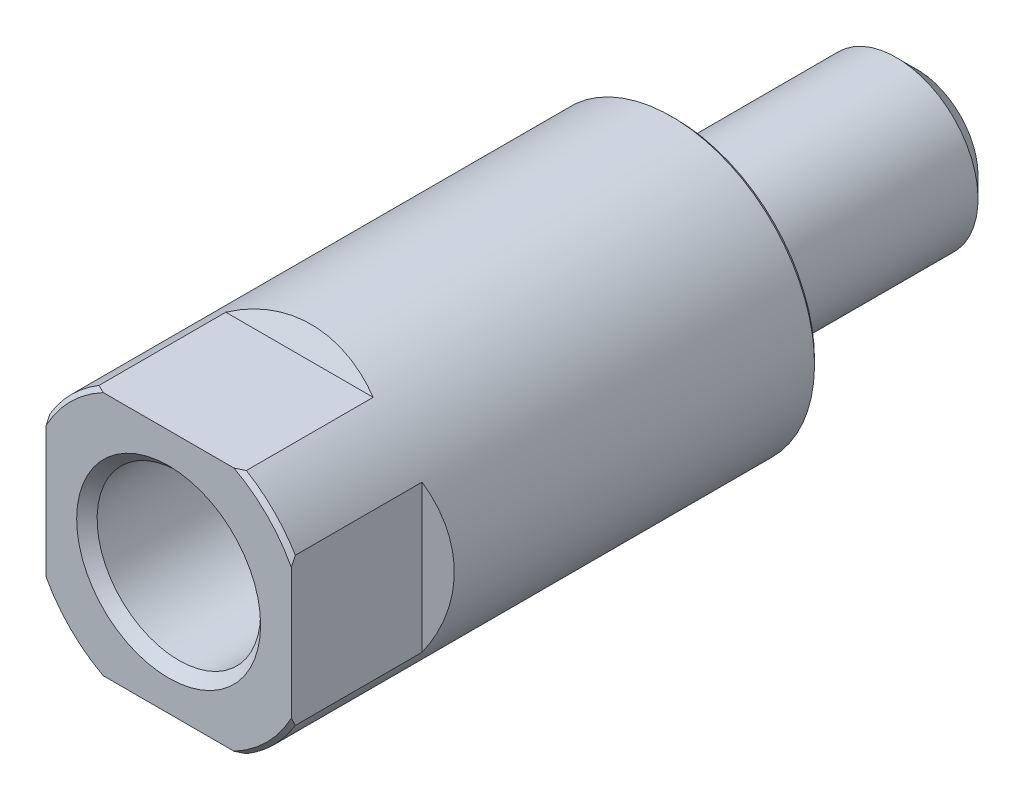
ISO-10303-21;
HEADER;
FILE_DESCRIPTION(('STEP AP214'),'2;1');
FILE_NAME('part.step','',(''),(''),'','','');
FILE_SCHEMA(('AUTOMOTIVE_DESIGN { 1 0 10303 214 1 1 1 1 }'));
ENDSEC;
DATA;
#1=APPLICATION_CONTEXT('core data for automotive mechanical design processes');
#2=APPLICATION_PROTOCOL_DEFINITION('international standard','automotive_design',2000,#1);
#3=PRODUCT_CONTEXT('',#1,'mechanical');
#4=PRODUCT('Part','Part','',(#3));
#5=PRODUCT_RELATED_PRODUCT_CATEGORY('part','',(#4));
#6=PRODUCT_DEFINITION_FORMATION('','',#4);
#7=PRODUCT_DEFINITION_CONTEXT('part definition',#1,'design');
#8=PRODUCT_DEFINITION('design','',#6,#7);
#9=PRODUCT_DEFINITION_SHAPE('','',#8);
#10=(LENGTH_UNIT() NAMED_UNIT(*) SI_UNIT(.MILLI.,.METRE.));
#11=(NAMED_UNIT(*) PLANE_ANGLE_UNIT() SI_UNIT($,.RADIAN.));
#12=(NAMED_UNIT(*) SI_UNIT($,.STERADIAN.) SOLID_ANGLE_UNIT());
#13=UNCERTAINTY_MEASURE_WITH_UNIT(LENGTH_MEASURE(1.E-05),#10,'distance_accuracy_value','');
#14=(GEOMETRIC_REPRESENTATION_CONTEXT(3) GLOBAL_UNCERTAINTY_ASSIGNED_CONTEXT((#13)) GLOBAL_UNIT_ASSIGNED_CONTEXT((#10,
#11,#12)) REPRESENTATION_CONTEXT('',''));
#15=CARTESIAN_POINT('',(0.,0.,0.));
#16=DIRECTION('',(0.,0.,1.));
#17=DIRECTION('',(1.,0.,0.));
#18=AXIS2_PLACEMENT_3D('',#15,#16,#17);
#19=CARTESIAN_POINT('',(0.,0.,-9.));
#20=DIRECTION('',(0.,0.,1.));
#21=DIRECTION('',(0.,-1.,0.));
#22=AXIS2_PLACEMENT_3D('',#19,#20,#21);
#23=CYLINDRICAL_SURFACE('',#22,10.);
#24=CARTESIAN_POINT('',(0.,0.,1.25));
#25=DIRECTION('',(0.,0.,-1.));
#26=DIRECTION('',(0.,1.,0.));
#27=AXIS2_PLACEMENT_3D('',#24,#25,#26);
#28=CIRCLE('',#27,10.);
#29=CARTESIAN_POINT('',(0.,10.,1.25));
#30=VERTEX_POINT('',#29);
#31=EDGE_CURVE('E9',#30,#30,#28,.F.);
#32=ORIENTED_EDGE('',*,*,#31,.F.);
#33=EDGE_LOOP('',(#32));
#34=FACE_BOUND('',#33,.T.);
#35=CARTESIAN_POINT('',(0.,0.,-27.));
#36=DIRECTION('',(0.,0.,1.));
#37=DIRECTION('',(0.,-1.,0.));
#38=AXIS2_PLACEMENT_3D('',#35,#36,#37);
#39=CIRCLE('',#38,10.);
#40=CARTESIAN_POINT('',(0.,-10.,-27.));
#41=VERTEX_POINT('',#40);
#42=EDGE_CURVE('E367',#41,#41,#39,.T.);
#43=ORIENTED_EDGE('',*,*,#42,.T.);
#44=EDGE_LOOP('',(#43));
#45=FACE_BOUND('',#44,.T.);
#46=ADVANCED_FACE('F14',(#34,#45),#23,.T.);
#47=CARTESIAN_POINT('',(-15.,10.,46.));
#48=DIRECTION('',(0.5,0.,-0.866025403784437));
#49=DIRECTION('',(0.866025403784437,0.,0.5));
#50=AXIS2_PLACEMENT_3D('',#47,#48,#49);
#51=PLANE('',#50);
#52=CARTESIAN_POINT('',(0.,0.,54.6602540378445));
#53=DIRECTION('',(0.5,0.,-0.866025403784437));
#54=DIRECTION('',(-0.866025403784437,0.,-0.5));
#55=AXIS2_PLACEMENT_3D('',#52,#53,#54);
#56=ELLIPSE('',#55,20.2072594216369,17.5);
#57=CARTESIAN_POINT('',(-15.,-9.01387818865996,46.));
#58=VERTEX_POINT('',#57);
#59=CARTESIAN_POINT('',(-15.,9.01387818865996,46.));
#60=VERTEX_POINT('',#59);
#61=EDGE_CURVE('E163',#58,#60,#56,.T.);
#62=ORIENTED_EDGE('',*,*,#61,.F.);
#63=DIRECTION('',(0.,-1.,0.));
#64=VECTOR('',#63,1.);
#65=CARTESIAN_POINT('',(-15.,10.,46.));
#66=LINE('',#65,#64);
#67=EDGE_CURVE('E139',#60,#58,#66,.T.);
#68=ORIENTED_EDGE('',*,*,#67,.F.);
#69=EDGE_LOOP('',(#62,#68));
#70=FACE_BOUND('',#69,.T.);
#71=ADVANCED_FACE('F207',(#70),#51,.F.);
#72=CARTESIAN_POINT('',(10.,-15.,46.));
#73=DIRECTION('',(0.,0.5,-0.866025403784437));
#74=DIRECTION('',(0.,0.866025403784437,0.5));
#75=AXIS2_PLACEMENT_3D('',#72,#73,#74);
#76=PLANE('',#75);
#77=CARTESIAN_POINT('',(0.,0.,54.6602540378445));
#78=DIRECTION('',(0.,0.5,-0.866025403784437));
#79=DIRECTION('',(0.,-0.866025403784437,-0.5));
#80=AXIS2_PLACEMENT_3D('',#77,#78,#79);
#81=ELLIPSE('',#80,20.2072594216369,17.5);
#82=CARTESIAN_POINT('',(9.01387818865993,-15.,46.));
#83=VERTEX_POINT('',#82);
#84=CARTESIAN_POINT('',(-9.01387818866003,-15.,46.));
#85=VERTEX_POINT('',#84);
#86=EDGE_CURVE('E167',#83,#85,#81,.T.);
#87=ORIENTED_EDGE('',*,*,#86,.F.);
#88=DIRECTION('',(-1.,0.,0.));
#89=VECTOR('',#88,1.);
#90=CARTESIAN_POINT('',(10.,-15.,46.));
#91=LINE('',#90,#89);
#92=EDGE_CURVE('E132',#83,#85,#91,.T.);
#93=ORIENTED_EDGE('',*,*,#92,.T.);
#94=EDGE_LOOP('',(#87,#93));
#95=FACE_BOUND('',#94,.T.);
#96=ADVANCED_FACE('F213',(#95),#76,.F.);
#97=CARTESIAN_POINT('',(15.,10.,46.));
#98=DIRECTION('',(-0.5,0.,-0.866025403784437));
#99=DIRECTION('',(0.866025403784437,0.,-0.5));
#100=AXIS2_PLACEMENT_3D('',#97,#98,#99);
#101=PLANE('',#100);
#102=CARTESIAN_POINT('',(0.,0.,54.6602540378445));
#103=DIRECTION('',(-0.5,0.,-0.866025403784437));
#104=DIRECTION('',(0.866025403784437,0.,-0.5));
#105=AXIS2_PLACEMENT_3D('',#102,#103,#104);
#106=ELLIPSE('',#105,20.2072594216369,17.5);
#107=CARTESIAN_POINT('',(15.,9.01387818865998,46.));
#108=VERTEX_POINT('',#107);
#109=CARTESIAN_POINT('',(15.,-9.01387818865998,46.));
#110=VERTEX_POINT('',#109);
#111=EDGE_CURVE('E157',#108,#110,#106,.T.);
#112=ORIENTED_EDGE('',*,*,#111,.F.);
#113=DIRECTION('',(0.,-1.,0.));
#114=VECTOR('',#113,1.);
#115=CARTESIAN_POINT('',(15.,10.,46.));
#116=LINE('',#115,#114);
#117=EDGE_CURVE('E146',#108,#110,#116,.T.);
#118=ORIENTED_EDGE('',*,*,#117,.T.);
#119=EDGE_LOOP('',(#112,#118));
#120=FACE_BOUND('',#119,.T.);
#121=ADVANCED_FACE('F209',(#120),#101,.F.);
#122=CARTESIAN_POINT('',(10.,15.,46.));
#123=DIRECTION('',(0.,-0.5,-0.866025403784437));
#124=DIRECTION('',(0.,0.866025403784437,-0.5));
#125=AXIS2_PLACEMENT_3D('',#122,#123,#124);
#126=PLANE('',#125);
#127=CARTESIAN_POINT('',(0.,0.,54.6602540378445));
#128=DIRECTION('',(0.,-0.5,-0.866025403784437));
#129=DIRECTION('',(0.,0.866025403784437,-0.5));
#130=AXIS2_PLACEMENT_3D('',#127,#128,#129);
#131=ELLIPSE('',#130,20.2072594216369,17.5);
#132=CARTESIAN_POINT('',(-9.01387818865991,15.,46.));
#133=VERTEX_POINT('',#132);
#134=CARTESIAN_POINT('',(9.01387818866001,15.,46.));
#135=VERTEX_POINT('',#134);
#136=EDGE_CURVE('E105',#133,#135,#131,.T.);
#137=ORIENTED_EDGE('',*,*,#136,.F.);
#138=DIRECTION('',(-1.,0.,0.));
#139=VECTOR('',#138,1.);
#140=CARTESIAN_POINT('',(10.,15.,46.));
#141=LINE('',#140,#139);
#142=EDGE_CURVE('E119',#135,#133,#141,.T.);
#143=ORIENTED_EDGE('',*,*,#142,.F.);
#144=EDGE_LOOP('',(#137,#143));
#145=FACE_BOUND('',#144,.T.);
#146=ADVANCED_FACE('F123',(#145),#126,.F.);
#147=CARTESIAN_POINT('',(0.,0.,62.));
#148=DIRECTION('',(0.,0.,-1.));
#149=DIRECTION('',(0.,1.,0.));
#150=AXIS2_PLACEMENT_3D('',#147,#148,#149);
#151=CONICAL_SURFACE('',#150,17.,0.785398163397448);
#152=CARTESIAN_POINT('',(15.,9.01387818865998,61.5));
#153=CARTESIAN_POINT('',(15.,8.93012197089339,61.5431408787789));
#154=CARTESIAN_POINT('',(15.,8.84618583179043,61.5859330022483));
#155=CARTESIAN_POINT('',(15.,8.67795393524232,61.6707874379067));
#156=CARTESIAN_POINT('',(15.,8.59365820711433,61.7128498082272));
#157=CARTESIAN_POINT('',(15.,8.4246936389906,61.7962195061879));
#158=CARTESIAN_POINT('',(15.,8.34002479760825,61.8375268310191));
#159=CARTESIAN_POINT('',(15.,8.17030148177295,61.9193589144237));
#160=CARTESIAN_POINT('',(15.,8.08524697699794,61.9598836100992));
#161=CARTESIAN_POINT('',(15.,8.,62.));
#162=B_SPLINE_CURVE_WITH_KNOTS('',3,(#152,#153,#154,#155,#156,#157,#158,#159,#160,#161),
.UNSPECIFIED.,.F.,.F.,(4,2,2,2,4),(0.,0.282640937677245,0.565259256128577,0.847878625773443,
1.13052061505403),.UNSPECIFIED.);
#163=CARTESIAN_POINT('',(15.,9.01387818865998,61.5));
#164=VERTEX_POINT('',#163);
#165=CARTESIAN_POINT('',(15.,8.,62.));
#166=VERTEX_POINT('',#165);
#167=EDGE_CURVE('E233',#164,#166,#162,.T.);
#168=ORIENTED_EDGE('',*,*,#167,.F.);
#169=CARTESIAN_POINT('',(0.,0.,61.5));
#170=DIRECTION('',(0.,0.,1.));
#171=DIRECTION('',(0.,-1.,0.));
#172=AXIS2_PLACEMENT_3D('',#169,#170,#171);
#173=CIRCLE('',#172,17.5);
#174=CARTESIAN_POINT('',(9.01387818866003,15.,61.5));
#175=VERTEX_POINT('',#174);
#176=EDGE_CURVE('E296',#175,#164,#173,.F.);
#177=ORIENTED_EDGE('',*,*,#176,.F.);
#178=CARTESIAN_POINT('',(8.,15.,62.));
#179=CARTESIAN_POINT('',(8.08524697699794,15.,61.9598836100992));
#180=CARTESIAN_POINT('',(8.17030148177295,15.,61.9193589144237));
#181=CARTESIAN_POINT('',(8.34002479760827,15.,61.8375268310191));
#182=CARTESIAN_POINT('',(8.42469363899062,15.,61.7962195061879));
#183=CARTESIAN_POINT('',(8.59365820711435,15.,61.7128498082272));
#184=CARTESIAN_POINT('',(8.67795393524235,15.,61.6707874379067));
#185=CARTESIAN_POINT('',(8.84618583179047,15.,61.5859330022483));
#186=CARTESIAN_POINT('',(8.93012197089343,15.,61.5431408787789));
#187=CARTESIAN_POINT('',(9.01387818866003,15.,61.5));
#188=B_SPLINE_CURVE_WITH_KNOTS('',3,(#178,#179,#180,#181,#182,#183,#184,#185,#186,#187),
.UNSPECIFIED.,.F.,.F.,(4,2,2,2,4),(0.,0.282641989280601,0.565261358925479,0.847879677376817,
1.13052061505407),.UNSPECIFIED.);
#189=CARTESIAN_POINT('',(8.,15.,62.));
#190=VERTEX_POINT('',#189);
#191=EDGE_CURVE('E121',#190,#175,#188,.T.);
#192=ORIENTED_EDGE('',*,*,#191,.F.);
#193=CARTESIAN_POINT('',(0.,0.,62.));
#194=DIRECTION('',(0.,0.,1.));
#195=DIRECTION('',(0.,-1.,0.));
#196=AXIS2_PLACEMENT_3D('',#193,#194,#195);
#197=CIRCLE('',#196,17.);
#198=EDGE_CURVE('E173',#166,#190,#197,.T.);
#199=ORIENTED_EDGE('',*,*,#198,.F.);
#200=EDGE_LOOP('',(#168,#177,#192,#199));
#201=FACE_BOUND('',#200,.T.);
#202=ADVANCED_FACE('F220',(#201),#151,.T.);
#203=CARTESIAN_POINT('',(15.,10.,62.));
#204=DIRECTION('',(-1.,0.,0.));
#205=DIRECTION('',(0.,0.,-1.));
#206=AXIS2_PLACEMENT_3D('',#203,#204,#205);
#207=PLANE('',#206);
#208=DIRECTION('',(0.,0.,-1.));
#209=VECTOR('',#208,1.);
#210=CARTESIAN_POINT('',(15.,9.01387818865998,62.));
#211=LINE('',#210,#209);
#212=EDGE_CURVE('E152',#164,#108,#211,.T.);
#213=ORIENTED_EDGE('',*,*,#212,.F.);
#214=ORIENTED_EDGE('',*,*,#167,.T.);
#215=DIRECTION('',(0.,-1.,0.));
#216=VECTOR('',#215,1.);
#217=CARTESIAN_POINT('',(15.,0.,62.));
#218=LINE('',#217,#216);
#219=CARTESIAN_POINT('',(15.,-8.,62.));
#220=VERTEX_POINT('',#219);
#221=EDGE_CURVE('E154',#166,#220,#218,.T.);
#222=ORIENTED_EDGE('',*,*,#221,.T.);
#223=CARTESIAN_POINT('',(15.,-8.,62.));
#224=CARTESIAN_POINT('',(15.,-8.08524697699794,61.9598836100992));
#225=CARTESIAN_POINT('',(15.,-8.17030148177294,61.9193589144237));
#226=CARTESIAN_POINT('',(15.,-8.34002479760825,61.8375268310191));
#227=CARTESIAN_POINT('',(15.,-8.4246936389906,61.7962195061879));
#228=CARTESIAN_POINT('',(15.,-8.59365820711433,61.7128498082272));
#229=CARTESIAN_POINT('',(15.,-8.67795393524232,61.6707874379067));
#230=CARTESIAN_POINT('',(15.,-8.84618583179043,61.5859330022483));
#231=CARTESIAN_POINT('',(15.,-8.93012197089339,61.5431408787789));
#232=CARTESIAN_POINT('',(15.,-9.01387818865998,61.5));
#233=B_SPLINE_CURVE_WITH_KNOTS('',3,(#223,#224,#225,#226,#227,#228,#229,#230,#231,#232),
.UNSPECIFIED.,.F.,.F.,(4,2,2,2,4),(0.,0.282641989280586,0.565261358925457,0.847879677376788,
1.13052061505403),.UNSPECIFIED.);
#234=CARTESIAN_POINT('',(15.,-9.01387818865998,61.5));
#235=VERTEX_POINT('',#234);
#236=EDGE_CURVE('E226',#220,#235,#233,.T.);
#237=ORIENTED_EDGE('',*,*,#236,.T.);
#238=DIRECTION('',(0.,0.,-1.));
#239=VECTOR('',#238,1.);
#240=CARTESIAN_POINT('',(15.,-9.01387818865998,62.));
#241=LINE('',#240,#239);
#242=EDGE_CURVE('E149',#110,#235,#241,.F.);
#243=ORIENTED_EDGE('',*,*,#242,.F.);
#244=ORIENTED_EDGE('',*,*,#117,.F.);
#245=EDGE_LOOP('',(#213,#214,#222,#237,#243,#244));
#246=FACE_BOUND('',#245,.T.);
#247=ADVANCED_FACE('F215',(#246),#207,.F.);
#248=CARTESIAN_POINT('',(0.,0.,62.));
#249=DIRECTION('',(0.,0.,-1.));
#250=DIRECTION('',(0.,1.,0.));
#251=AXIS2_PLACEMENT_3D('',#248,#249,#250);
#252=CONICAL_SURFACE('',#251,17.,0.785398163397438);
#253=CARTESIAN_POINT('',(9.01387818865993,-15.,61.5));
#254=CARTESIAN_POINT('',(8.93012197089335,-15.,61.5431408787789));
#255=CARTESIAN_POINT('',(8.8461858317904,-15.,61.5859330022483));
#256=CARTESIAN_POINT('',(8.67795393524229,-15.,61.6707874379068));
#257=CARTESIAN_POINT('',(8.5936582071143,-15.,61.7128498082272));
#258=CARTESIAN_POINT('',(8.42469363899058,-15.,61.7962195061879));
#259=CARTESIAN_POINT('',(8.34002479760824,-15.,61.8375268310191));
#260=CARTESIAN_POINT('',(8.17030148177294,-15.,61.9193589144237));
#261=CARTESIAN_POINT('',(8.08524697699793,-15.,61.9598836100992));
#262=CARTESIAN_POINT('',(8.,-15.,62.));
#263=B_SPLINE_CURVE_WITH_KNOTS('',3,(#253,#254,#255,#256,#257,#258,#259,#260,#261,#262),
.UNSPECIFIED.,.F.,.F.,(4,2,2,2,4),(0.,0.282640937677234,0.565259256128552,0.847878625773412,
1.13052061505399),.UNSPECIFIED.);
#264=CARTESIAN_POINT('',(9.01387818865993,-15.,61.5));
#265=VERTEX_POINT('',#264);
#266=CARTESIAN_POINT('',(8.,-15.,62.));
#267=VERTEX_POINT('',#266);
#268=EDGE_CURVE('E270',#265,#267,#263,.T.);
#269=ORIENTED_EDGE('',*,*,#268,.F.);
#270=CARTESIAN_POINT('',(0.,0.,61.5));
#271=DIRECTION('',(0.,0.,1.));
#272=DIRECTION('',(0.,-1.,0.));
#273=AXIS2_PLACEMENT_3D('',#270,#271,#272);
#274=CIRCLE('',#273,17.5);
#275=EDGE_CURVE('E293',#235,#265,#274,.F.);
#276=ORIENTED_EDGE('',*,*,#275,.F.);
#277=ORIENTED_EDGE('',*,*,#236,.F.);
#278=CARTESIAN_POINT('',(0.,0.,62.));
#279=DIRECTION('',(0.,0.,1.));
#280=DIRECTION('',(0.,-1.,0.));
#281=AXIS2_PLACEMENT_3D('',#278,#279,#280);
#282=CIRCLE('',#281,17.);
#283=EDGE_CURVE('E114',#267,#220,#282,.T.);
#284=ORIENTED_EDGE('',*,*,#283,.F.);
#285=EDGE_LOOP('',(#269,#276,#277,#284));
#286=FACE_BOUND('',#285,.T.);
#287=ADVANCED_FACE('F219',(#286),#252,.T.);
#288=CARTESIAN_POINT('',(10.,-15.,62.));
#289=DIRECTION('',(0.,1.,0.));
#290=DIRECTION('',(-1.,0.,0.));
#291=AXIS2_PLACEMENT_3D('',#288,#289,#290);
#292=PLANE('',#291);
#293=DIRECTION('',(-1.,0.,0.));
#294=VECTOR('',#293,1.);
#295=CARTESIAN_POINT('',(0.,-15.,62.));
#296=LINE('',#295,#294);
#297=CARTESIAN_POINT('',(-8.,-15.,62.));
#298=VERTEX_POINT('',#297);
#299=EDGE_CURVE('E165',#267,#298,#296,.T.);
#300=ORIENTED_EDGE('',*,*,#299,.T.);
#301=CARTESIAN_POINT('',(-8.,-15.,62.));
#302=CARTESIAN_POINT('',(-8.08524697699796,-15.,61.9598836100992));
#303=CARTESIAN_POINT('',(-8.17030148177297,-14.9999999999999,61.9193589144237));
#304=CARTESIAN_POINT('',(-8.34002479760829,-14.9999999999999,61.8375268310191));
#305=CARTESIAN_POINT('',(-8.42469363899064,-14.9999999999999,61.7962195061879));
#306=CARTESIAN_POINT('',(-8.59365820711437,-14.9999999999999,61.7128498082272));
#307=CARTESIAN_POINT('',(-8.67795393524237,-14.9999999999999,61.6707874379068));
#308=CARTESIAN_POINT('',(-8.84618583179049,-14.9999999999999,61.5859330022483));
#309=CARTESIAN_POINT('',(-8.93012197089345,-15.,61.5431408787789));
#310=CARTESIAN_POINT('',(-9.01387818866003,-15.,61.5));
#311=B_SPLINE_CURVE_WITH_KNOTS('',3,(#301,#302,#303,#304,#305,#306,#307,#308,#309,#310),
.UNSPECIFIED.,.F.,.F.,(4,2,2,2,4),(0.,0.282641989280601,0.565261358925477,0.84787967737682,
1.13052061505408),.UNSPECIFIED.);
#312=CARTESIAN_POINT('',(-9.01387818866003,-15.,61.5));
#313=VERTEX_POINT('',#312);
#314=EDGE_CURVE('E39',#298,#313,#311,.T.);
#315=ORIENTED_EDGE('',*,*,#314,.T.);
#316=DIRECTION('',(0.,0.,-1.));
#317=VECTOR('',#316,1.);
#318=CARTESIAN_POINT('',(-9.01387818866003,-15.,62.));
#319=LINE('',#318,#317);
#320=EDGE_CURVE('E135',#85,#313,#319,.F.);
#321=ORIENTED_EDGE('',*,*,#320,.F.);
#322=ORIENTED_EDGE('',*,*,#92,.F.);
#323=DIRECTION('',(0.,0.,-1.));
#324=VECTOR('',#323,1.);
#325=CARTESIAN_POINT('',(9.01387818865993,-15.,62.));
#326=LINE('',#325,#324);
#327=EDGE_CURVE('E137',#265,#83,#326,.T.);
#328=ORIENTED_EDGE('',*,*,#327,.F.);
#329=ORIENTED_EDGE('',*,*,#268,.T.);
#330=EDGE_LOOP('',(#300,#315,#321,#322,#328,#329));
#331=FACE_BOUND('',#330,.T.);
#332=ADVANCED_FACE('F266',(#331),#292,.F.);
#333=CARTESIAN_POINT('',(0.,0.,62.));
#334=DIRECTION('',(0.,0.,-1.));
#335=DIRECTION('',(0.,1.,0.));
#336=AXIS2_PLACEMENT_3D('',#333,#334,#335);
#337=CONICAL_SURFACE('',#336,17.,0.785398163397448);
#338=CARTESIAN_POINT('',(-15.,-9.01387818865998,61.5));
#339=CARTESIAN_POINT('',(-15.,-8.93012197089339,61.5431408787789));
#340=CARTESIAN_POINT('',(-15.,-8.84618583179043,61.5859330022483));
#341=CARTESIAN_POINT('',(-15.,-8.67795393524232,61.6707874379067));
#342=CARTESIAN_POINT('',(-15.,-8.59365820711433,61.7128498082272));
#343=CARTESIAN_POINT('',(-15.,-8.4246936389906,61.7962195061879));
#344=CARTESIAN_POINT('',(-15.,-8.34002479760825,61.8375268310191));
#345=CARTESIAN_POINT('',(-15.,-8.17030148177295,61.9193589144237));
#346=CARTESIAN_POINT('',(-15.,-8.08524697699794,61.9598836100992));
#347=CARTESIAN_POINT('',(-15.,-8.,62.));
#348=B_SPLINE_CURVE_WITH_KNOTS('',3,(#338,#339,#340,#341,#342,#343,#344,#345,#346,#347),
.UNSPECIFIED.,.F.,.F.,(4,2,2,2,4),(0.,0.282640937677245,0.565259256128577,0.847878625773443,
1.13052061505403),.UNSPECIFIED.);
#349=CARTESIAN_POINT('',(-15.,-9.01387818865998,61.5));
#350=VERTEX_POINT('',#349);
#351=CARTESIAN_POINT('',(-15.,-8.,62.));
#352=VERTEX_POINT('',#351);
#353=EDGE_CURVE('E182',#350,#352,#348,.T.);
#354=ORIENTED_EDGE('',*,*,#353,.F.);
#355=CARTESIAN_POINT('',(0.,0.,61.5));
#356=DIRECTION('',(0.,0.,1.));
#357=DIRECTION('',(0.,-1.,0.));
#358=AXIS2_PLACEMENT_3D('',#355,#356,#357);
#359=CIRCLE('',#358,17.5);
#360=EDGE_CURVE('E299',#313,#350,#359,.F.);
#361=ORIENTED_EDGE('',*,*,#360,.F.);
#362=ORIENTED_EDGE('',*,*,#314,.F.);
#363=CARTESIAN_POINT('',(0.,0.,62.));
#364=DIRECTION('',(0.,0.,1.));
#365=DIRECTION('',(0.,-1.,0.));
#366=AXIS2_PLACEMENT_3D('',#363,#364,#365);
#367=CIRCLE('',#366,17.);
#368=EDGE_CURVE('E176',#352,#298,#367,.T.);
#369=ORIENTED_EDGE('',*,*,#368,.F.);
#370=EDGE_LOOP('',(#354,#361,#362,#369));
#371=FACE_BOUND('',#370,.T.);
#372=ADVANCED_FACE('F197',(#371),#337,.T.);
#373=CARTESIAN_POINT('',(-15.,10.,62.));
#374=DIRECTION('',(1.,0.,0.));
#375=DIRECTION('',(0.,0.,1.));
#376=AXIS2_PLACEMENT_3D('',#373,#374,#375);
#377=PLANE('',#376);
#378=DIRECTION('',(0.,1.,0.));
#379=VECTOR('',#378,1.);
#380=CARTESIAN_POINT('',(-15.,0.,62.));
#381=LINE('',#380,#379);
#382=CARTESIAN_POINT('',(-15.,8.,62.));
#383=VERTEX_POINT('',#382);
#384=EDGE_CURVE('E160',#352,#383,#381,.T.);
#385=ORIENTED_EDGE('',*,*,#384,.T.);
#386=CARTESIAN_POINT('',(-15.,8.,62.));
#387=CARTESIAN_POINT('',(-15.,8.08524697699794,61.9598836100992));
#388=CARTESIAN_POINT('',(-15.,8.17030148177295,61.9193589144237));
#389=CARTESIAN_POINT('',(-15.,8.34002479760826,61.8375268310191));
#390=CARTESIAN_POINT('',(-15.,8.4246936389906,61.7962195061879));
#391=CARTESIAN_POINT('',(-15.,8.59365820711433,61.7128498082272));
#392=CARTESIAN_POINT('',(-15.,8.67795393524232,61.6707874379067));
#393=CARTESIAN_POINT('',(-15.,8.84618583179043,61.5859330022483));
#394=CARTESIAN_POINT('',(-15.,8.93012197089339,61.5431408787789));
#395=CARTESIAN_POINT('',(-15.,9.01387818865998,61.5));
#396=B_SPLINE_CURVE_WITH_KNOTS('',3,(#386,#387,#388,#389,#390,#391,#392,#393,#394,#395),
.UNSPECIFIED.,.F.,.F.,(4,2,2,2,4),(0.,0.282641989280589,0.565261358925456,0.847879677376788,
1.13052061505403),.UNSPECIFIED.);
#397=CARTESIAN_POINT('',(-15.,9.01387818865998,61.5));
#398=VERTEX_POINT('',#397);
#399=EDGE_CURVE('E190',#383,#398,#396,.T.);
#400=ORIENTED_EDGE('',*,*,#399,.T.);
#401=DIRECTION('',(0.,0.,-1.));
#402=VECTOR('',#401,1.);
#403=CARTESIAN_POINT('',(-15.,9.01387818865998,62.));
#404=LINE('',#403,#402);
#405=EDGE_CURVE('E142',#60,#398,#404,.F.);
#406=ORIENTED_EDGE('',*,*,#405,.F.);
#407=ORIENTED_EDGE('',*,*,#67,.T.);
#408=DIRECTION('',(0.,0.,-1.));
#409=VECTOR('',#408,1.);
#410=CARTESIAN_POINT('',(-15.,-9.01387818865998,62.));
#411=LINE('',#410,#409);
#412=EDGE_CURVE('E144',#350,#58,#411,.T.);
#413=ORIENTED_EDGE('',*,*,#412,.F.);
#414=ORIENTED_EDGE('',*,*,#353,.T.);
#415=EDGE_LOOP('',(#385,#400,#406,#407,#413,#414));
#416=FACE_BOUND('',#415,.T.);
#417=ADVANCED_FACE('F200',(#416),#377,.F.);
#418=CARTESIAN_POINT('',(0.,0.,62.));
#419=DIRECTION('',(0.,0.,-1.));
#420=DIRECTION('',(0.,1.,0.));
#421=AXIS2_PLACEMENT_3D('',#418,#419,#420);
#422=CONICAL_SURFACE('',#421,17.,0.785398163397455);
#423=CARTESIAN_POINT('',(-9.01387818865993,15.,61.5));
#424=CARTESIAN_POINT('',(-8.93012197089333,15.,61.5431408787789));
#425=CARTESIAN_POINT('',(-8.84618583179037,15.0000000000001,61.5859330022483));
#426=CARTESIAN_POINT('',(-8.67795393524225,15.0000000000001,61.6707874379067));
#427=CARTESIAN_POINT('',(-8.59365820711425,15.0000000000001,61.7128498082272));
#428=CARTESIAN_POINT('',(-8.42469363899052,15.0000000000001,61.7962195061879));
#429=CARTESIAN_POINT('',(-8.34002479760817,15.0000000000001,61.8375268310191));
#430=CARTESIAN_POINT('',(-8.17030148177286,15.0000000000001,61.9193589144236));
#431=CARTESIAN_POINT('',(-8.08524697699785,15.,61.9598836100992));
#432=CARTESIAN_POINT('',(-7.99999999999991,15.,62.));
#433=B_SPLINE_CURVE_WITH_KNOTS('',3,(#423,#424,#425,#426,#427,#428,#429,#430,#431,#432),
.UNSPECIFIED.,.F.,.F.,(4,2,2,2,4),(0.,0.282640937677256,0.565259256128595,0.847878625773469,
1.13052061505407),.UNSPECIFIED.);
#434=CARTESIAN_POINT('',(-9.01387818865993,15.,61.5));
#435=VERTEX_POINT('',#434);
#436=CARTESIAN_POINT('',(-7.99999999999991,15.,62.));
#437=VERTEX_POINT('',#436);
#438=EDGE_CURVE('E251',#435,#437,#433,.T.);
#439=ORIENTED_EDGE('',*,*,#438,.F.);
#440=CARTESIAN_POINT('',(0.,0.,61.5));
#441=DIRECTION('',(0.,0.,1.));
#442=DIRECTION('',(0.,-1.,0.));
#443=AXIS2_PLACEMENT_3D('',#440,#441,#442);
#444=CIRCLE('',#443,17.5);
#445=EDGE_CURVE('E31',#398,#435,#444,.F.);
#446=ORIENTED_EDGE('',*,*,#445,.F.);
#447=ORIENTED_EDGE('',*,*,#399,.F.);
#448=CARTESIAN_POINT('',(0.,0.,62.));
#449=DIRECTION('',(0.,0.,1.));
#450=DIRECTION('',(0.,-1.,0.));
#451=AXIS2_PLACEMENT_3D('',#448,#449,#450);
#452=CIRCLE('',#451,17.);
#453=EDGE_CURVE('E179',#437,#383,#452,.T.);
#454=ORIENTED_EDGE('',*,*,#453,.F.);
#455=EDGE_LOOP('',(#439,#446,#447,#454));
#456=FACE_BOUND('',#455,.T.);
#457=ADVANCED_FACE('F205',(#456),#422,.T.);
#458=CARTESIAN_POINT('',(10.,15.,62.));
#459=DIRECTION('',(0.,-1.,0.));
#460=DIRECTION('',(1.,0.,0.));
#461=AXIS2_PLACEMENT_3D('',#458,#459,#460);
#462=PLANE('',#461);
#463=DIRECTION('',(0.,0.,-1.));
#464=VECTOR('',#463,1.);
#465=CARTESIAN_POINT('',(-9.01387818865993,15.,62.));
#466=LINE('',#465,#464);
#467=EDGE_CURVE('E110',#435,#133,#466,.T.);
#468=ORIENTED_EDGE('',*,*,#467,.F.);
#469=ORIENTED_EDGE('',*,*,#438,.T.);
#470=DIRECTION('',(1.,0.,0.));
#471=VECTOR('',#470,1.);
#472=CARTESIAN_POINT('',(0.,15.,62.));
#473=LINE('',#472,#471);
#474=EDGE_CURVE('E115',#437,#190,#473,.T.);
#475=ORIENTED_EDGE('',*,*,#474,.T.);
#476=ORIENTED_EDGE('',*,*,#191,.T.);
#477=DIRECTION('',(0.,0.,-1.));
#478=VECTOR('',#477,1.);
#479=CARTESIAN_POINT('',(9.01387818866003,15.,62.));
#480=LINE('',#479,#478);
#481=EDGE_CURVE('E108',#135,#175,#480,.F.);
#482=ORIENTED_EDGE('',*,*,#481,.F.);
#483=ORIENTED_EDGE('',*,*,#142,.T.);
#484=EDGE_LOOP('',(#468,#469,#475,#476,#482,#483));
#485=FACE_BOUND('',#484,.T.);
#486=ADVANCED_FACE('F118',(#485),#462,.F.);
#487=CARTESIAN_POINT('',(0.,0.,62.));
#488=DIRECTION('',(0.,0.,1.));
#489=DIRECTION('',(0.,-1.,0.));
#490=AXIS2_PLACEMENT_3D('',#487,#488,#489);
#491=PLANE('',#490);
#492=CARTESIAN_POINT('',(0.,0.,62.));
#493=DIRECTION('',(0.,0.,1.));
#494=DIRECTION('',(0.,-1.,0.));
#495=AXIS2_PLACEMENT_3D('',#492,#493,#494);
#496=CIRCLE('',#495,11.25);
#497=CARTESIAN_POINT('',(0.,-11.25,62.));
#498=VERTEX_POINT('',#497);
#499=EDGE_CURVE('E127',#498,#498,#496,.T.);
#500=ORIENTED_EDGE('',*,*,#499,.F.);
#501=EDGE_LOOP('',(#500));
#502=FACE_BOUND('',#501,.T.);
#503=ORIENTED_EDGE('',*,*,#474,.F.);
#504=ORIENTED_EDGE('',*,*,#453,.T.);
#505=ORIENTED_EDGE('',*,*,#384,.F.);
#506=ORIENTED_EDGE('',*,*,#368,.T.);
#507=ORIENTED_EDGE('',*,*,#299,.F.);
#508=ORIENTED_EDGE('',*,*,#283,.T.);
#509=ORIENTED_EDGE('',*,*,#221,.F.);
#510=ORIENTED_EDGE('',*,*,#198,.T.);
#511=EDGE_LOOP('',(#503,#504,#505,#506,#507,#508,#509,#510));
#512=FACE_BOUND('',#511,.T.);
#513=ADVANCED_FACE('F222',(#502,#512),#491,.T.);
#514=CARTESIAN_POINT('',(0.,0.,62.));
#515=DIRECTION('',(0.,0.,1.));
#516=DIRECTION('',(0.,-1.,0.));
#517=AXIS2_PLACEMENT_3D('',#514,#515,#516);
#518=CONICAL_SURFACE('',#517,11.25,0.785398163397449);
#519=CARTESIAN_POINT('',(0.,0.,60.75));
#520=DIRECTION('',(0.,0.,1.));
#521=DIRECTION('',(1.,0.,0.));
#522=AXIS2_PLACEMENT_3D('',#519,#520,#521);
#523=CIRCLE('',#522,10.);
#524=CARTESIAN_POINT('',(10.,0.,60.75));
#525=VERTEX_POINT('',#524);
#526=EDGE_CURVE('E18',#525,#525,#523,.F.);
#527=ORIENTED_EDGE('',*,*,#526,.T.);
#528=EDGE_LOOP('',(#527));
#529=FACE_BOUND('',#528,.T.);
#530=ORIENTED_EDGE('',*,*,#499,.T.);
#531=EDGE_LOOP('',(#530));
#532=FACE_BOUND('',#531,.T.);
#533=ADVANCED_FACE('F352',(#529,#532),#518,.F.);
#534=CARTESIAN_POINT('',(0.,0.,62.));
#535=DIRECTION('',(0.,0.,-1.));
#536=DIRECTION('',(0.,1.,0.));
#537=AXIS2_PLACEMENT_3D('',#534,#535,#536);
#538=CYLINDRICAL_SURFACE('',#537,17.5);
#539=CARTESIAN_POINT('',(0.,0.,0.499999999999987));
#540=DIRECTION('',(0.,0.,1.));
#541=DIRECTION('',(0.,-1.,0.));
#542=AXIS2_PLACEMENT_3D('',#539,#540,#541);
#543=CIRCLE('',#542,17.5);
#544=CARTESIAN_POINT('',(0.,-17.5,0.499999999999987));
#545=VERTEX_POINT('',#544);
#546=EDGE_CURVE('E291',#545,#545,#543,.T.);
#547=ORIENTED_EDGE('',*,*,#546,.T.);
#548=EDGE_LOOP('',(#547));
#549=FACE_BOUND('',#548,.T.);
#550=ORIENTED_EDGE('',*,*,#405,.T.);
#551=ORIENTED_EDGE('',*,*,#445,.T.);
#552=ORIENTED_EDGE('',*,*,#467,.T.);
#553=ORIENTED_EDGE('',*,*,#136,.T.);
#554=ORIENTED_EDGE('',*,*,#481,.T.);
#555=ORIENTED_EDGE('',*,*,#176,.T.);
#556=ORIENTED_EDGE('',*,*,#212,.T.);
#557=ORIENTED_EDGE('',*,*,#111,.T.);
#558=ORIENTED_EDGE('',*,*,#242,.T.);
#559=ORIENTED_EDGE('',*,*,#275,.T.);
#560=ORIENTED_EDGE('',*,*,#327,.T.);
#561=ORIENTED_EDGE('',*,*,#86,.T.);
#562=ORIENTED_EDGE('',*,*,#320,.T.);
#563=ORIENTED_EDGE('',*,*,#360,.T.);
#564=ORIENTED_EDGE('',*,*,#412,.T.);
#565=ORIENTED_EDGE('',*,*,#61,.T.);
#566=EDGE_LOOP('',(#550,#551,#552,#553,#554,#555,#556,#557,#558,#559,#560,#561,#562,#563,#564,#565));
#567=FACE_BOUND('',#566,.T.);
#568=ADVANCED_FACE('F107',(#549,#567),#538,.T.);
#569=CARTESIAN_POINT('',(0.,0.,0.499999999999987));
#570=DIRECTION('',(0.,0.,1.));
#571=DIRECTION('',(0.,-1.,0.));
#572=AXIS2_PLACEMENT_3D('',#569,#570,#571);
#573=CONICAL_SURFACE('',#572,17.5,0.785398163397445);
#574=CARTESIAN_POINT('',(0.,0.,0.));
#575=DIRECTION('',(0.,0.,1.));
#576=DIRECTION('',(0.,-1.,0.));
#577=AXIS2_PLACEMENT_3D('',#574,#575,#576);
#578=CIRCLE('',#577,17.);
#579=CARTESIAN_POINT('',(0.,-17.,0.));
#580=VERTEX_POINT('',#579);
#581=EDGE_CURVE('E23',#580,#580,#578,.F.);
#582=ORIENTED_EDGE('',*,*,#581,.F.);
#583=EDGE_LOOP('',(#582));
#584=FACE_BOUND('',#583,.T.);
#585=ORIENTED_EDGE('',*,*,#546,.F.);
#586=EDGE_LOOP('',(#585));
#587=FACE_BOUND('',#586,.T.);
#588=ADVANCED_FACE('F16',(#584,#587),#573,.T.);
#589=CARTESIAN_POINT('',(0.,0.,0.));
#590=DIRECTION('',(0.,0.,1.));
#591=DIRECTION('',(0.,-1.,0.));
#592=AXIS2_PLACEMENT_3D('',#589,#590,#591);
#593=PLANE('',#592);
#594=ORIENTED_EDGE('',*,*,#581,.T.);
#595=EDGE_LOOP('',(#594));
#596=FACE_BOUND('',#595,.T.);
#597=CARTESIAN_POINT('',(0.,0.,0.));
#598=DIRECTION('',(0.,0.,1.));
#599=DIRECTION('',(0.,-1.,0.));
#600=AXIS2_PLACEMENT_3D('',#597,#598,#599);
#601=CIRCLE('',#600,11.25);
#602=CARTESIAN_POINT('',(0.,-11.25,0.));
#603=VERTEX_POINT('',#602);
#604=EDGE_CURVE('E124',#603,#603,#601,.T.);
#605=ORIENTED_EDGE('',*,*,#604,.T.);
#606=EDGE_LOOP('',(#605));
#607=FACE_BOUND('',#606,.T.);
#608=ADVANCED_FACE('F343',(#596,#607),#593,.F.);
#609=CARTESIAN_POINT('',(0.,0.,2.5));
#610=DIRECTION('',(0.,0.,-1.));
#611=DIRECTION('',(0.,1.,0.));
#612=AXIS2_PLACEMENT_3D('',#609,#610,#611);
#613=CONICAL_SURFACE('',#612,8.75,0.785398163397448);
#614=ORIENTED_EDGE('',*,*,#604,.F.);
#615=EDGE_LOOP('',(#614));
#616=FACE_BOUND('',#615,.T.);
#617=ORIENTED_EDGE('',*,*,#31,.T.);
#618=EDGE_LOOP('',(#617));
#619=FACE_BOUND('',#618,.T.);
#620=ADVANCED_FACE('F330',(#616,#619),#613,.F.);
#621=CARTESIAN_POINT('',(0.,0.,-27.));
#622=DIRECTION('',(0.,0.,1.));
#623=DIRECTION('',(0.,-1.,0.));
#624=AXIS2_PLACEMENT_3D('',#621,#622,#623);
#625=CONICAL_SURFACE('',#624,10.,0.785398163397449);
#626=CARTESIAN_POINT('',(0.,0.,-29.5));
#627=DIRECTION('',(0.,0.,1.));
#628=DIRECTION('',(0.,-1.,0.));
#629=AXIS2_PLACEMENT_3D('',#626,#627,#628);
#630=CIRCLE('',#629,7.5);
#631=CARTESIAN_POINT('',(0.,-7.5,-29.5));
#632=VERTEX_POINT('',#631);
#633=EDGE_CURVE('E369',#632,#632,#630,.T.);
#634=ORIENTED_EDGE('',*,*,#633,.T.);
#635=EDGE_LOOP('',(#634));
#636=FACE_BOUND('',#635,.T.);
#637=ORIENTED_EDGE('',*,*,#42,.F.);
#638=EDGE_LOOP('',(#637));
#639=FACE_BOUND('',#638,.T.);
#640=ADVANCED_FACE('F329',(#636,#639),#625,.T.);
#641=CARTESIAN_POINT('',(0.,0.,-29.5));
#642=DIRECTION('',(0.,0.,-1.));
#643=DIRECTION('',(0.,1.,0.));
#644=AXIS2_PLACEMENT_3D('',#641,#642,#643);
#645=PLANE('',#644);
#646=ORIENTED_EDGE('',*,*,#633,.F.);
#647=EDGE_LOOP('',(#646));
#648=FACE_BOUND('',#647,.T.);
#649=ADVANCED_FACE('F339',(#648),#645,.T.);
#650=CARTESIAN_POINT('',(0.,0.,-7.28427124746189));
#651=DIRECTION('',(0.,0.,1.));
#652=DIRECTION('',(1.,0.,0.));
#653=AXIS2_PLACEMENT_3D('',#650,#651,#652);
#654=CYLINDRICAL_SURFACE('',#653,10.);
#655=CARTESIAN_POINT('',(0.,0.,21.));
#656=DIRECTION('',(0.,0.,-1.));
#657=DIRECTION('',(-1.,0.,0.));
#658=AXIS2_PLACEMENT_3D('',#655,#656,#657);
#659=CIRCLE('',#658,10.);
#660=CARTESIAN_POINT('',(-10.,0.,21.));
#661=VERTEX_POINT('',#660);
#662=EDGE_CURVE('E374',#661,#661,#659,.F.);
#663=ORIENTED_EDGE('',*,*,#662,.F.);
#664=EDGE_LOOP('',(#663));
#665=FACE_BOUND('',#664,.T.);
#666=ORIENTED_EDGE('',*,*,#526,.F.);
#667=EDGE_LOOP('',(#666));
#668=FACE_BOUND('',#667,.T.);
#669=ADVANCED_FACE('F380',(#665,#668),#654,.F.);
#670=CARTESIAN_POINT('',(0.,-10.,21.));
#671=DIRECTION('',(0.,0.,-1.));
#672=DIRECTION('',(0.,1.,0.));
#673=AXIS2_PLACEMENT_3D('',#670,#671,#672);
#674=PLANE('',#673);
#675=ORIENTED_EDGE('',*,*,#662,.T.);
#676=EDGE_LOOP('',(#675));
#677=FACE_BOUND('',#676,.T.);
#678=ADVANCED_FACE('F378',(#677),#674,.F.);
#679=CLOSED_SHELL('',(#46,#71,#96,#121,#146,#202,#247,#287,#332,#372,#417,#457,#486,#513,#533,
#568,#588,#608,#620,#640,#649,#669,#678));
#680=MANIFOLD_SOLID_BREP('B1',#679);
#681=ADVANCED_BREP_SHAPE_REPRESENTATION('',(#18,#680),#14);
#682=SHAPE_DEFINITION_REPRESENTATION(#9,#681);
ENDSEC;
END-ISO-10303-21;
